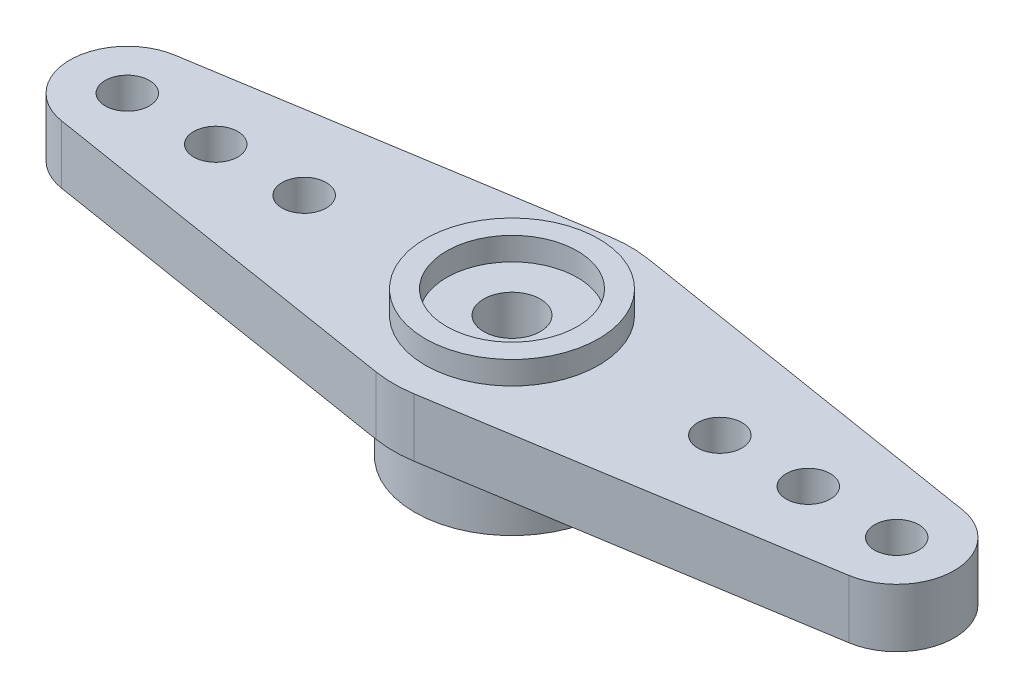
from build123d import *
from build123d.topology import SkipClean

# Parameters (mm, degrees)
ESQUISSE1_R             = 1.6
ESQUISSE1_R_2           = 1.25
BOSS_EXTRU_1_DEPTH      = 3.3
ESQUISSE7_R             = 5.5
BOSS_EXTRU_3_DEPTH      = 3.6
ESQUISSE10_R            = 3
ENL_V_MAT_EXTRU_6_DEPTH = 3.4
ESQUISSE11_R            = 1.6
ENL_V_MAT_EXTRU_7_DEPTH = 27.786190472
ESQUISSE12_R            = 4.9
ESQUISSE12_R_2          = 3.7
BOSS_EXTRU_5_DEPTH      = 1.3


with BuildPart() as part:
    # Esquisse1 → Boss.-Extru.1 (new body)
    with BuildSketch(Plane(origin=(0, 0, 0), x_dir=(1, 0, 0), z_dir=(0, 1, 0))):
        with BuildLine():
            Line((22.265517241, 3.208853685), (1.062758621, 6.61517529))
            ThreePointArc((1.062758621, 6.61517529), (0, 6.7), (-1.062758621, 6.61517529))
            Line((-1.062758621, 6.61517529), (-22.265517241, 3.208853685))
            ThreePointArc((-22.265517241, 3.208853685), (-25, 0), (-22.265517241, -3.208853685))
            Line((-22.265517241, -3.208853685), (-1.062758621, -6.61517529))
            ThreePointArc((-1.062758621, -6.61517529), (0, -6.7), (1.062758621, -6.61517529))
            Line((1.062758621, -6.61517529), (22.265517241, -3.208853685))
            ThreePointArc((22.265517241, -3.208853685), (25, 0), (22.265517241, 3.208853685))
        make_face()
        with Locations(Location((0, 0, 0), (0, 0, 270))):
            Circle(ESQUISSE1_R, mode=Mode.SUBTRACT)
        with Locations(Location((21.75, 0, 0), (0, 0, 270))):
            Circle(ESQUISSE1_R_2, mode=Mode.SUBTRACT)
        with Locations(Location((16.75, 0, 0), (0, 0, 270))):
            Circle(ESQUISSE1_R_2, mode=Mode.SUBTRACT)
        with Locations(Location((11.75, 0, 0), (0, 0, 270))):
            Circle(ESQUISSE1_R_2, mode=Mode.SUBTRACT)
        with Locations(Location((-21.75, 0, 0), (0, 0, 270))):
            Circle(ESQUISSE1_R_2, mode=Mode.SUBTRACT)
        with Locations(Location((-16.75, 0, 0), (0, 0, 270))):
            Circle(ESQUISSE1_R_2, mode=Mode.SUBTRACT)
        with Locations(Location((-11.75, 0, 0), (0, 0, 270))):
            Circle(ESQUISSE1_R_2, mode=Mode.SUBTRACT)
    extrude(amount=BOSS_EXTRU_1_DEPTH)

    # Esquisse7 → Boss.-Extru.3 (add)
    with BuildSketch(Plane.XZ):
        with Locations(Location((0, 0, 0), (0, 0, 90))):
            Circle(ESQUISSE7_R)
    extrude(amount=BOSS_EXTRU_3_DEPTH)

    # Esquisse10 → Enl_v. mat.-Extru.6 (cut)
    with BuildSketch(Plane.XZ.offset(3.6)):
        with Locations(Location((0, 0, 0), (0, 0, 270))):
            Circle(ESQUISSE10_R)
    extrude(amount=-ENL_V_MAT_EXTRU_6_DEPTH, mode=Mode.SUBTRACT)

    # Esquisse11 → Enl_v. mat.-Extru.7 (cut, through all)
    with SkipClean():  # the faces are left unmerged after this step: merging them gives an invalid solid
        with BuildSketch(Plane(origin=(0, 3.3, 0), x_dir=(1, 0, 0), z_dir=(0, 1, 0))):
            with Locations(Location((0, 0, 0), (0, 0, 90))):
                Circle(ESQUISSE11_R)
        extrude(amount=-ENL_V_MAT_EXTRU_7_DEPTH, mode=Mode.SUBTRACT)

    # Esquisse12 → Boss.-Extru.5 (add)
    with BuildSketch(Plane(origin=(0, 3.3, 0), x_dir=(1, 0, 0), z_dir=(0, 1, 0))):
        with Locations(Location((0, 0, 0), (0, 0, 270))):
            Circle(ESQUISSE12_R)
        with Locations(Location((0, 0, 0), (0, 0, 270))):
            Circle(ESQUISSE12_R_2, mode=Mode.SUBTRACT)
    extrude(amount=BOSS_EXTRU_5_DEPTH)


solid = part.part
